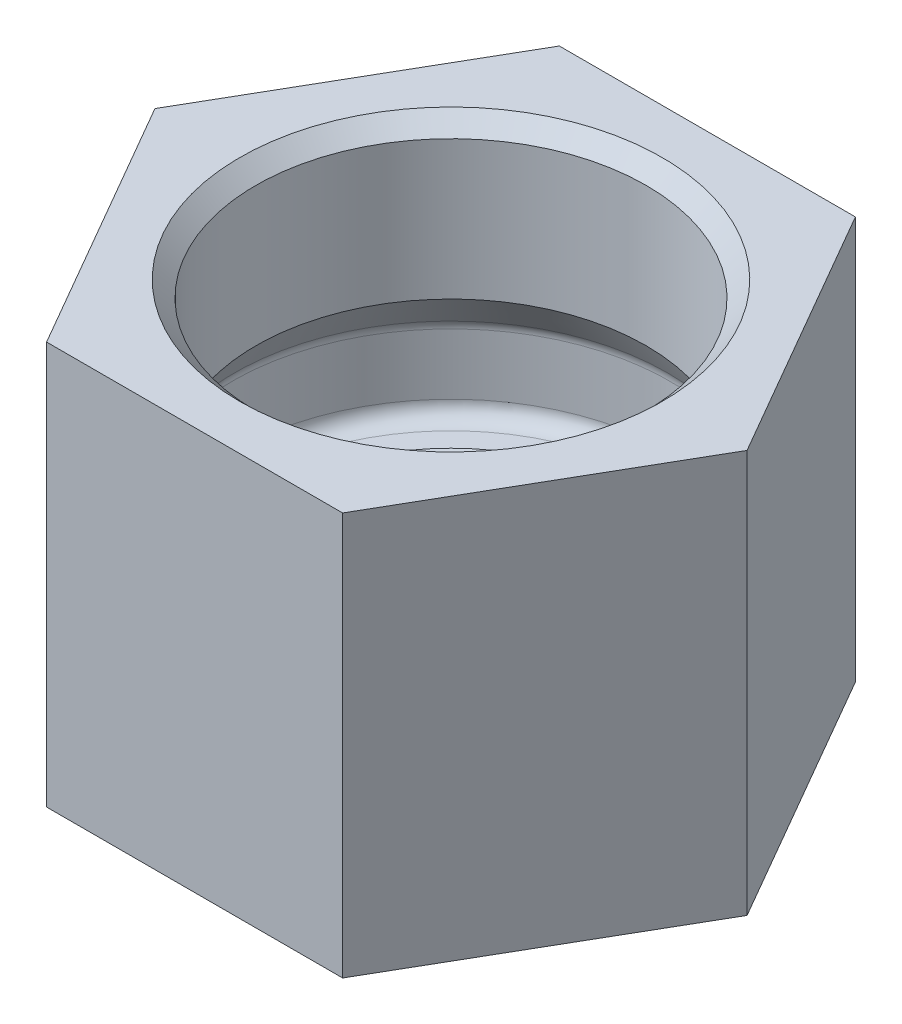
ISO-10303-21;
HEADER;
FILE_DESCRIPTION(('STEP AP214'),'2;1');
FILE_NAME('part.step','',(''),(''),'','','');
FILE_SCHEMA(('AUTOMOTIVE_DESIGN { 1 0 10303 214 1 1 1 1 }'));
ENDSEC;
DATA;
#1=APPLICATION_CONTEXT('core data for automotive mechanical design processes');
#2=APPLICATION_PROTOCOL_DEFINITION('international standard','automotive_design',2000,#1);
#3=PRODUCT_CONTEXT('',#1,'mechanical');
#4=PRODUCT('Part','Part','',(#3));
#5=PRODUCT_RELATED_PRODUCT_CATEGORY('part','',(#4));
#6=PRODUCT_DEFINITION_FORMATION('','',#4);
#7=PRODUCT_DEFINITION_CONTEXT('part definition',#1,'design');
#8=PRODUCT_DEFINITION('design','',#6,#7);
#9=PRODUCT_DEFINITION_SHAPE('','',#8);
#10=(LENGTH_UNIT() NAMED_UNIT(*) SI_UNIT(.MILLI.,.METRE.));
#11=(NAMED_UNIT(*) PLANE_ANGLE_UNIT() SI_UNIT($,.RADIAN.));
#12=(NAMED_UNIT(*) SI_UNIT($,.STERADIAN.) SOLID_ANGLE_UNIT());
#13=UNCERTAINTY_MEASURE_WITH_UNIT(LENGTH_MEASURE(1.E-05),#10,'distance_accuracy_value','');
#14=(GEOMETRIC_REPRESENTATION_CONTEXT(3) GLOBAL_UNCERTAINTY_ASSIGNED_CONTEXT((#13)) GLOBAL_UNIT_ASSIGNED_CONTEXT((#10,
#11,#12)) REPRESENTATION_CONTEXT('',''));
#15=CARTESIAN_POINT('',(0.,0.,0.));
#16=DIRECTION('',(0.,0.,1.));
#17=DIRECTION('',(1.,0.,0.));
#18=AXIS2_PLACEMENT_3D('',#15,#16,#17);
#19=CARTESIAN_POINT('',(6.92820323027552,18.85,12.));
#20=DIRECTION('',(-0.866025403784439,0.,-0.5));
#21=DIRECTION('',(-0.5,0.,0.866025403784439));
#22=AXIS2_PLACEMENT_3D('',#19,#20,#21);
#23=PLANE('',#22);
#24=DIRECTION('',(0.5,0.,-0.866025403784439));
#25=VECTOR('',#24,1.);
#26=CARTESIAN_POINT('',(6.92820323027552,0.,12.));
#27=LINE('',#26,#25);
#28=CARTESIAN_POINT('',(6.92820323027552,0.,12.));
#29=VERTEX_POINT('',#28);
#30=CARTESIAN_POINT('',(13.856406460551,0.,0.));
#31=VERTEX_POINT('',#30);
#32=EDGE_CURVE('E121',#29,#31,#27,.T.);
#33=ORIENTED_EDGE('',*,*,#32,.T.);
#34=DIRECTION('',(0.,-1.,0.));
#35=VECTOR('',#34,1.);
#36=CARTESIAN_POINT('',(13.856406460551,18.85,0.));
#37=LINE('',#36,#35);
#38=CARTESIAN_POINT('',(13.856406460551,18.85,0.));
#39=VERTEX_POINT('',#38);
#40=EDGE_CURVE('E11',#39,#31,#37,.T.);
#41=ORIENTED_EDGE('',*,*,#40,.F.);
#42=DIRECTION('',(0.5,0.,-0.866025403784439));
#43=VECTOR('',#42,1.);
#44=CARTESIAN_POINT('',(6.92820323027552,18.85,12.));
#45=LINE('',#44,#43);
#46=CARTESIAN_POINT('',(6.92820323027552,18.85,12.));
#47=VERTEX_POINT('',#46);
#48=EDGE_CURVE('E131',#47,#39,#45,.T.);
#49=ORIENTED_EDGE('',*,*,#48,.F.);
#50=DIRECTION('',(0.,-1.,0.));
#51=VECTOR('',#50,1.);
#52=CARTESIAN_POINT('',(6.92820323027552,18.85,12.));
#53=LINE('',#52,#51);
#54=EDGE_CURVE('E117',#47,#29,#53,.T.);
#55=ORIENTED_EDGE('',*,*,#54,.T.);
#56=EDGE_LOOP('',(#33,#41,#49,#55));
#57=FACE_BOUND('',#56,.T.);
#58=ADVANCED_FACE('F36',(#57),#23,.F.);
#59=CARTESIAN_POINT('',(13.856406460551,18.85,0.));
#60=DIRECTION('',(-0.866025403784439,0.,0.5));
#61=DIRECTION('',(0.5,0.,0.866025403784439));
#62=AXIS2_PLACEMENT_3D('',#59,#60,#61);
#63=PLANE('',#62);
#64=DIRECTION('',(-0.5,0.,-0.866025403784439));
#65=VECTOR('',#64,1.);
#66=CARTESIAN_POINT('',(13.856406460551,0.,0.));
#67=LINE('',#66,#65);
#68=CARTESIAN_POINT('',(6.92820323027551,0.,-12.));
#69=VERTEX_POINT('',#68);
#70=EDGE_CURVE('E124',#31,#69,#67,.T.);
#71=ORIENTED_EDGE('',*,*,#70,.T.);
#72=DIRECTION('',(0.,-1.,0.));
#73=VECTOR('',#72,1.);
#74=CARTESIAN_POINT('',(6.92820323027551,18.85,-12.));
#75=LINE('',#74,#73);
#76=CARTESIAN_POINT('',(6.92820323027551,18.85,-12.));
#77=VERTEX_POINT('',#76);
#78=EDGE_CURVE('E45',#77,#69,#75,.T.);
#79=ORIENTED_EDGE('',*,*,#78,.F.);
#80=DIRECTION('',(-0.5,0.,-0.866025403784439));
#81=VECTOR('',#80,1.);
#82=CARTESIAN_POINT('',(13.856406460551,18.85,0.));
#83=LINE('',#82,#81);
#84=EDGE_CURVE('E90',#39,#77,#83,.T.);
#85=ORIENTED_EDGE('',*,*,#84,.F.);
#86=ORIENTED_EDGE('',*,*,#40,.T.);
#87=EDGE_LOOP('',(#71,#79,#85,#86));
#88=FACE_BOUND('',#87,.T.);
#89=ADVANCED_FACE('F157',(#88),#63,.F.);
#90=CARTESIAN_POINT('',(6.92820323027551,18.85,-12.));
#91=DIRECTION('',(0.,0.,1.));
#92=DIRECTION('',(1.,0.,0.));
#93=AXIS2_PLACEMENT_3D('',#90,#91,#92);
#94=PLANE('',#93);
#95=DIRECTION('',(-1.,0.,0.));
#96=VECTOR('',#95,1.);
#97=CARTESIAN_POINT('',(6.92820323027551,0.,-12.));
#98=LINE('',#97,#96);
#99=CARTESIAN_POINT('',(-6.92820323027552,0.,-12.));
#100=VERTEX_POINT('',#99);
#101=EDGE_CURVE('E126',#69,#100,#98,.T.);
#102=ORIENTED_EDGE('',*,*,#101,.T.);
#103=DIRECTION('',(0.,-1.,0.));
#104=VECTOR('',#103,1.);
#105=CARTESIAN_POINT('',(-6.92820323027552,18.85,-12.));
#106=LINE('',#105,#104);
#107=CARTESIAN_POINT('',(-6.92820323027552,18.85,-12.));
#108=VERTEX_POINT('',#107);
#109=EDGE_CURVE('E112',#108,#100,#106,.T.);
#110=ORIENTED_EDGE('',*,*,#109,.F.);
#111=DIRECTION('',(-1.,0.,0.));
#112=VECTOR('',#111,1.);
#113=CARTESIAN_POINT('',(6.92820323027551,18.85,-12.));
#114=LINE('',#113,#112);
#115=EDGE_CURVE('E103',#77,#108,#114,.T.);
#116=ORIENTED_EDGE('',*,*,#115,.F.);
#117=ORIENTED_EDGE('',*,*,#78,.T.);
#118=EDGE_LOOP('',(#102,#110,#116,#117));
#119=FACE_BOUND('',#118,.T.);
#120=ADVANCED_FACE('F138',(#119),#94,.F.);
#121=CARTESIAN_POINT('',(-6.92820323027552,18.85,-12.));
#122=DIRECTION('',(0.866025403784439,0.,0.5));
#123=DIRECTION('',(0.5,0.,-0.866025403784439));
#124=AXIS2_PLACEMENT_3D('',#121,#122,#123);
#125=PLANE('',#124);
#126=DIRECTION('',(-0.5,0.,0.866025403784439));
#127=VECTOR('',#126,1.);
#128=CARTESIAN_POINT('',(-6.92820323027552,0.,-12.));
#129=LINE('',#128,#127);
#130=CARTESIAN_POINT('',(-13.856406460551,0.,0.));
#131=VERTEX_POINT('',#130);
#132=EDGE_CURVE('E111',#100,#131,#129,.T.);
#133=ORIENTED_EDGE('',*,*,#132,.T.);
#134=DIRECTION('',(0.,-1.,0.));
#135=VECTOR('',#134,1.);
#136=CARTESIAN_POINT('',(-13.856406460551,18.85,0.));
#137=LINE('',#136,#135);
#138=CARTESIAN_POINT('',(-13.856406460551,18.85,0.));
#139=VERTEX_POINT('',#138);
#140=EDGE_CURVE('E108',#139,#131,#137,.T.);
#141=ORIENTED_EDGE('',*,*,#140,.F.);
#142=DIRECTION('',(-0.5,0.,0.866025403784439));
#143=VECTOR('',#142,1.);
#144=CARTESIAN_POINT('',(-6.92820323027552,18.85,-12.));
#145=LINE('',#144,#143);
#146=EDGE_CURVE('E97',#108,#139,#145,.T.);
#147=ORIENTED_EDGE('',*,*,#146,.F.);
#148=ORIENTED_EDGE('',*,*,#109,.T.);
#149=EDGE_LOOP('',(#133,#141,#147,#148));
#150=FACE_BOUND('',#149,.T.);
#151=ADVANCED_FACE('F109',(#150),#125,.F.);
#152=CARTESIAN_POINT('',(-13.856406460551,18.85,0.));
#153=DIRECTION('',(0.866025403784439,0.,-0.5));
#154=DIRECTION('',(-0.5,0.,-0.866025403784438));
#155=AXIS2_PLACEMENT_3D('',#152,#153,#154);
#156=PLANE('',#155);
#157=DIRECTION('',(0.5,0.,0.866025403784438));
#158=VECTOR('',#157,1.);
#159=CARTESIAN_POINT('',(-13.856406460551,0.,0.));
#160=LINE('',#159,#158);
#161=CARTESIAN_POINT('',(-6.92820323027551,0.,12.));
#162=VERTEX_POINT('',#161);
#163=EDGE_CURVE('E76',#131,#162,#160,.T.);
#164=ORIENTED_EDGE('',*,*,#163,.T.);
#165=DIRECTION('',(0.,-1.,0.));
#166=VECTOR('',#165,1.);
#167=CARTESIAN_POINT('',(-6.92820323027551,18.85,12.));
#168=LINE('',#167,#166);
#169=CARTESIAN_POINT('',(-6.92820323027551,18.85,12.));
#170=VERTEX_POINT('',#169);
#171=EDGE_CURVE('E113',#170,#162,#168,.T.);
#172=ORIENTED_EDGE('',*,*,#171,.F.);
#173=DIRECTION('',(0.5,0.,0.866025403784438));
#174=VECTOR('',#173,1.);
#175=CARTESIAN_POINT('',(-13.856406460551,18.85,0.));
#176=LINE('',#175,#174);
#177=EDGE_CURVE('E101',#139,#170,#176,.T.);
#178=ORIENTED_EDGE('',*,*,#177,.F.);
#179=ORIENTED_EDGE('',*,*,#140,.T.);
#180=EDGE_LOOP('',(#164,#172,#178,#179));
#181=FACE_BOUND('',#180,.T.);
#182=ADVANCED_FACE('F115',(#181),#156,.F.);
#183=CARTESIAN_POINT('',(-6.92820323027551,18.85,12.));
#184=DIRECTION('',(0.,0.,-1.));
#185=DIRECTION('',(-1.,0.,0.));
#186=AXIS2_PLACEMENT_3D('',#183,#184,#185);
#187=PLANE('',#186);
#188=DIRECTION('',(1.,0.,0.));
#189=VECTOR('',#188,1.);
#190=CARTESIAN_POINT('',(-6.92820323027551,0.,12.));
#191=LINE('',#190,#189);
#192=EDGE_CURVE('E82',#162,#29,#191,.T.);
#193=ORIENTED_EDGE('',*,*,#192,.T.);
#194=ORIENTED_EDGE('',*,*,#54,.F.);
#195=DIRECTION('',(1.,0.,0.));
#196=VECTOR('',#195,1.);
#197=CARTESIAN_POINT('',(-6.92820323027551,18.85,12.));
#198=LINE('',#197,#196);
#199=EDGE_CURVE('E53',#170,#47,#198,.T.);
#200=ORIENTED_EDGE('',*,*,#199,.F.);
#201=ORIENTED_EDGE('',*,*,#171,.T.);
#202=EDGE_LOOP('',(#193,#194,#200,#201));
#203=FACE_BOUND('',#202,.T.);
#204=ADVANCED_FACE('F145',(#203),#187,.F.);
#205=CARTESIAN_POINT('',(13.856406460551,18.85,0.));
#206=DIRECTION('',(0.,1.,0.));
#207=DIRECTION('',(0.,0.,1.));
#208=AXIS2_PLACEMENT_3D('',#205,#206,#207);
#209=PLANE('',#208);
#210=CARTESIAN_POINT('',(0.,18.85,0.));
#211=DIRECTION('',(0.,1.,0.));
#212=DIRECTION('',(0.,0.,1.));
#213=AXIS2_PLACEMENT_3D('',#210,#211,#212);
#214=CIRCLE('',#213,9.88849952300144);
#215=CARTESIAN_POINT('',(0.,18.85,9.88849952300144));
#216=VERTEX_POINT('',#215);
#217=EDGE_CURVE('E39',#216,#216,#214,.T.);
#218=ORIENTED_EDGE('',*,*,#217,.F.);
#219=EDGE_LOOP('',(#218));
#220=FACE_BOUND('',#219,.T.);
#221=ORIENTED_EDGE('',*,*,#48,.T.);
#222=ORIENTED_EDGE('',*,*,#84,.T.);
#223=ORIENTED_EDGE('',*,*,#115,.T.);
#224=ORIENTED_EDGE('',*,*,#146,.T.);
#225=ORIENTED_EDGE('',*,*,#177,.T.);
#226=ORIENTED_EDGE('',*,*,#199,.T.);
#227=EDGE_LOOP('',(#221,#222,#223,#224,#225,#226));
#228=FACE_BOUND('',#227,.T.);
#229=ADVANCED_FACE('F99',(#220,#228),#209,.T.);
#230=CARTESIAN_POINT('',(13.856406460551,0.,0.));
#231=DIRECTION('',(0.,1.,0.));
#232=DIRECTION('',(0.,0.,1.));
#233=AXIS2_PLACEMENT_3D('',#230,#231,#232);
#234=PLANE('',#233);
#235=CARTESIAN_POINT('',(0.,0.,0.));
#236=DIRECTION('',(0.,1.,0.));
#237=DIRECTION('',(0.,0.,1.));
#238=AXIS2_PLACEMENT_3D('',#235,#236,#237);
#239=CIRCLE('',#238,7.);
#240=CARTESIAN_POINT('',(0.,0.,7.));
#241=VERTEX_POINT('',#240);
#242=EDGE_CURVE('E319',#241,#241,#239,.T.);
#243=ORIENTED_EDGE('',*,*,#242,.T.);
#244=EDGE_LOOP('',(#243));
#245=FACE_BOUND('',#244,.T.);
#246=ORIENTED_EDGE('',*,*,#32,.F.);
#247=ORIENTED_EDGE('',*,*,#192,.F.);
#248=ORIENTED_EDGE('',*,*,#163,.F.);
#249=ORIENTED_EDGE('',*,*,#132,.F.);
#250=ORIENTED_EDGE('',*,*,#101,.F.);
#251=ORIENTED_EDGE('',*,*,#70,.F.);
#252=EDGE_LOOP('',(#246,#247,#248,#249,#250,#251));
#253=FACE_BOUND('',#252,.T.);
#254=ADVANCED_FACE('F141',(#245,#253),#234,.F.);
#255=CARTESIAN_POINT('',(0.,50.1952402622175,0.));
#256=DIRECTION('',(0.,1.,0.));
#257=DIRECTION('',(0.,0.,1.));
#258=AXIS2_PLACEMENT_3D('',#255,#256,#257);
#259=CYLINDRICAL_SURFACE('',#258,7.);
#260=ORIENTED_EDGE('',*,*,#242,.F.);
#261=EDGE_LOOP('',(#260));
#262=FACE_BOUND('',#261,.T.);
#263=CARTESIAN_POINT('',(0.,4.5,0.));
#264=DIRECTION('',(0.,1.,0.));
#265=DIRECTION('',(0.,0.,1.));
#266=AXIS2_PLACEMENT_3D('',#263,#264,#265);
#267=CIRCLE('',#266,7.);
#268=CARTESIAN_POINT('',(0.,4.5,7.));
#269=VERTEX_POINT('',#268);
#270=EDGE_CURVE('E316',#269,#269,#267,.T.);
#271=ORIENTED_EDGE('',*,*,#270,.T.);
#272=EDGE_LOOP('',(#271));
#273=FACE_BOUND('',#272,.T.);
#274=ADVANCED_FACE('F194',(#262,#273),#259,.F.);
#275=CARTESIAN_POINT('',(0.,6.,0.));
#276=DIRECTION('',(0.,1.,0.));
#277=DIRECTION('',(0.,0.,1.));
#278=AXIS2_PLACEMENT_3D('',#275,#276,#277);
#279=CONICAL_SURFACE('',#278,8.5,0.785398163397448);
#280=ORIENTED_EDGE('',*,*,#270,.F.);
#281=EDGE_LOOP('',(#280));
#282=FACE_BOUND('',#281,.T.);
#283=CARTESIAN_POINT('',(0.,6.,0.));
#284=DIRECTION('',(0.,1.,0.));
#285=DIRECTION('',(0.,0.,1.));
#286=AXIS2_PLACEMENT_3D('',#283,#284,#285);
#287=CIRCLE('',#286,8.5);
#288=CARTESIAN_POINT('',(0.,6.,8.5));
#289=VERTEX_POINT('',#288);
#290=EDGE_CURVE('E313',#289,#289,#287,.T.);
#291=ORIENTED_EDGE('',*,*,#290,.T.);
#292=EDGE_LOOP('',(#291));
#293=FACE_BOUND('',#292,.T.);
#294=ADVANCED_FACE('F203',(#282,#293),#279,.F.);
#295=CARTESIAN_POINT('',(0.,6.,8.5));
#296=DIRECTION('',(0.,-1.,0.));
#297=DIRECTION('',(0.,0.,-1.));
#298=AXIS2_PLACEMENT_3D('',#295,#296,#297);
#299=PLANE('',#298);
#300=ORIENTED_EDGE('',*,*,#290,.F.);
#301=EDGE_LOOP('',(#300));
#302=FACE_BOUND('',#301,.T.);
#303=CARTESIAN_POINT('',(0.,6.,0.));
#304=DIRECTION('',(0.,1.,0.));
#305=DIRECTION('',(0.,0.,1.));
#306=AXIS2_PLACEMENT_3D('',#303,#304,#305);
#307=CIRCLE('',#306,9.5);
#308=CARTESIAN_POINT('',(0.,6.,9.5));
#309=VERTEX_POINT('',#308);
#310=EDGE_CURVE('E310',#309,#309,#307,.T.);
#311=ORIENTED_EDGE('',*,*,#310,.T.);
#312=EDGE_LOOP('',(#311));
#313=FACE_BOUND('',#312,.T.);
#314=ADVANCED_FACE('F213',(#302,#313),#299,.F.);
#315=CARTESIAN_POINT('',(0.,6.75,0.));
#316=DIRECTION('',(0.,1.,0.));
#317=DIRECTION('',(0.,0.,1.));
#318=AXIS2_PLACEMENT_3D('',#315,#316,#317);
#319=TOROIDAL_SURFACE('',#318,9.5,0.750000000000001);
#320=ORIENTED_EDGE('',*,*,#310,.F.);
#321=EDGE_LOOP('',(#320));
#322=FACE_BOUND('',#321,.T.);
#323=CARTESIAN_POINT('',(0.,6.75,0.));
#324=DIRECTION('',(0.,1.,0.));
#325=DIRECTION('',(0.,0.,1.));
#326=AXIS2_PLACEMENT_3D('',#323,#324,#325);
#327=CIRCLE('',#326,10.25);
#328=CARTESIAN_POINT('',(0.,6.75,10.25));
#329=VERTEX_POINT('',#328);
#330=EDGE_CURVE('E307',#329,#329,#327,.T.);
#331=ORIENTED_EDGE('',*,*,#330,.T.);
#332=EDGE_LOOP('',(#331));
#333=FACE_BOUND('',#332,.T.);
#334=ADVANCED_FACE('F223',(#322,#333),#319,.F.);
#335=CARTESIAN_POINT('',(0.,50.1952402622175,0.));
#336=DIRECTION('',(0.,1.,0.));
#337=DIRECTION('',(0.,0.,1.));
#338=AXIS2_PLACEMENT_3D('',#335,#336,#337);
#339=CYLINDRICAL_SURFACE('',#338,10.25);
#340=ORIENTED_EDGE('',*,*,#330,.F.);
#341=EDGE_LOOP('',(#340));
#342=FACE_BOUND('',#341,.T.);
#343=CARTESIAN_POINT('',(0.,9.6,0.));
#344=DIRECTION('',(0.,1.,0.));
#345=DIRECTION('',(0.,0.,1.));
#346=AXIS2_PLACEMENT_3D('',#343,#344,#345);
#347=CIRCLE('',#346,10.25);
#348=CARTESIAN_POINT('',(0.,9.6,10.25));
#349=VERTEX_POINT('',#348);
#350=EDGE_CURVE('E304',#349,#349,#347,.T.);
#351=ORIENTED_EDGE('',*,*,#350,.T.);
#352=EDGE_LOOP('',(#351));
#353=FACE_BOUND('',#352,.T.);
#354=ADVANCED_FACE('F233',(#342,#353),#339,.F.);
#355=CARTESIAN_POINT('',(0.,9.6,0.));
#356=DIRECTION('',(0.,1.,0.));
#357=DIRECTION('',(0.,0.,1.));
#358=AXIS2_PLACEMENT_3D('',#355,#356,#357);
#359=TOROIDAL_SURFACE('',#358,9.5,0.749999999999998);
#360=ORIENTED_EDGE('',*,*,#350,.F.);
#361=EDGE_LOOP('',(#360));
#362=FACE_BOUND('',#361,.T.);
#363=CARTESIAN_POINT('',(0.,9.99749920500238,0.));
#364=DIRECTION('',(0.,1.,0.));
#365=DIRECTION('',(0.,0.,1.));
#366=AXIS2_PLACEMENT_3D('',#363,#364,#365);
#367=CIRCLE('',#366,10.1359987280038);
#368=CARTESIAN_POINT('',(0.,9.99749920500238,10.1359987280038));
#369=VERTEX_POINT('',#368);
#370=EDGE_CURVE('E299',#369,#369,#367,.T.);
#371=ORIENTED_EDGE('',*,*,#370,.T.);
#372=EDGE_LOOP('',(#371));
#373=FACE_BOUND('',#372,.T.);
#374=ADVANCED_FACE('F243',(#362,#373),#359,.F.);
#375=CARTESIAN_POINT('',(0.,11.5974992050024,0.));
#376=DIRECTION('',(0.,-1.,0.));
#377=DIRECTION('',(0.,0.,-1.));
#378=AXIS2_PLACEMENT_3D('',#375,#376,#377);
#379=CONICAL_SURFACE('',#378,9.13599872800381,0.558599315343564);
#380=ORIENTED_EDGE('',*,*,#370,.F.);
#381=EDGE_LOOP('',(#380));
#382=FACE_BOUND('',#381,.T.);
#383=CARTESIAN_POINT('',(0.,11.5974992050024,0.));
#384=DIRECTION('',(0.,1.,0.));
#385=DIRECTION('',(0.,0.,1.));
#386=AXIS2_PLACEMENT_3D('',#383,#384,#385);
#387=CIRCLE('',#386,9.13599872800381);
#388=CARTESIAN_POINT('',(0.,11.5974992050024,9.13599872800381));
#389=VERTEX_POINT('',#388);
#390=EDGE_CURVE('E296',#389,#389,#387,.T.);
#391=ORIENTED_EDGE('',*,*,#390,.T.);
#392=EDGE_LOOP('',(#391));
#393=FACE_BOUND('',#392,.T.);
#394=ADVANCED_FACE('F253',(#382,#393),#379,.F.);
#395=CARTESIAN_POINT('',(0.,50.1952402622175,0.));
#396=DIRECTION('',(0.,1.,0.));
#397=DIRECTION('',(0.,0.,1.));
#398=AXIS2_PLACEMENT_3D('',#395,#396,#397);
#399=CYLINDRICAL_SURFACE('',#398,9.13599872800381);
#400=ORIENTED_EDGE('',*,*,#390,.F.);
#401=EDGE_LOOP('',(#400));
#402=FACE_BOUND('',#401,.T.);
#403=CARTESIAN_POINT('',(0.,18.0974992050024,0.));
#404=DIRECTION('',(0.,1.,0.));
#405=DIRECTION('',(0.,0.,1.));
#406=AXIS2_PLACEMENT_3D('',#403,#404,#405);
#407=CIRCLE('',#406,9.13599872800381);
#408=CARTESIAN_POINT('',(0.,18.0974992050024,9.13599872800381));
#409=VERTEX_POINT('',#408);
#410=EDGE_CURVE('E294',#409,#409,#407,.T.);
#411=ORIENTED_EDGE('',*,*,#410,.T.);
#412=EDGE_LOOP('',(#411));
#413=FACE_BOUND('',#412,.T.);
#414=ADVANCED_FACE('F263',(#402,#413),#399,.F.);
#415=CARTESIAN_POINT('',(0.,18.8974992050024,0.));
#416=DIRECTION('',(0.,1.,0.));
#417=DIRECTION('',(0.,0.,1.));
#418=AXIS2_PLACEMENT_3D('',#415,#416,#417);
#419=CONICAL_SURFACE('',#418,9.93599872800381,0.78539816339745);
#420=ORIENTED_EDGE('',*,*,#217,.T.);
#421=EDGE_LOOP('',(#420));
#422=FACE_BOUND('',#421,.T.);
#423=ORIENTED_EDGE('',*,*,#410,.F.);
#424=EDGE_LOOP('',(#423));
#425=FACE_BOUND('',#424,.T.);
#426=ADVANCED_FACE('F274',(#422,#425),#419,.F.);
#427=CLOSED_SHELL('',(#58,#89,#120,#151,#182,#204,#229,#254,#274,#294,#314,#334,#354,#374,#394,
#414,#426));
#428=MANIFOLD_SOLID_BREP('B2',#427);
#429=ADVANCED_BREP_SHAPE_REPRESENTATION('',(#18,#428),#14);
#430=SHAPE_DEFINITION_REPRESENTATION(#9,#429);
ENDSEC;
END-ISO-10303-21;
